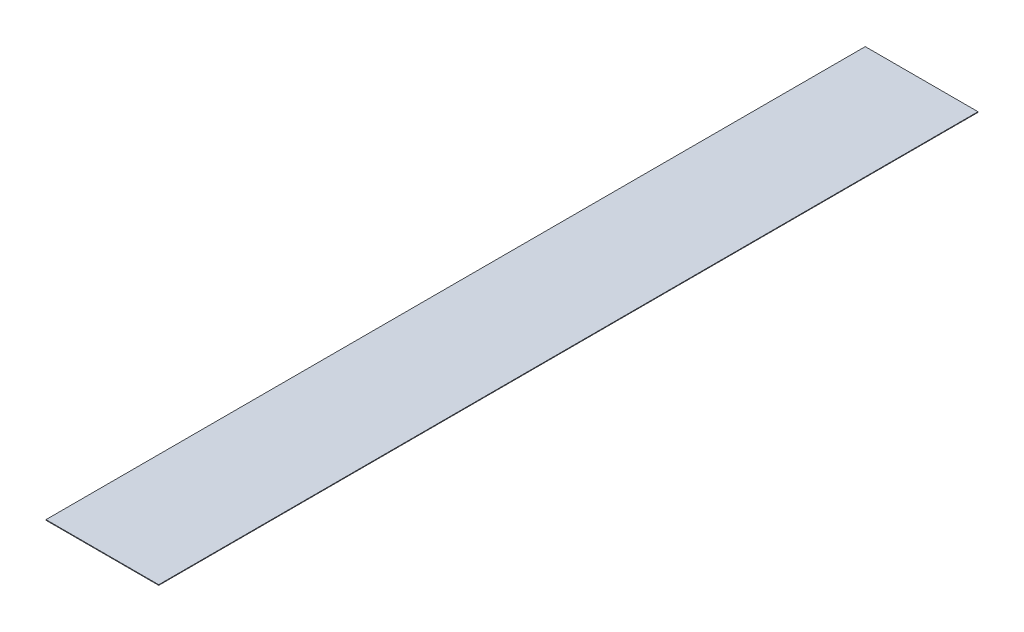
ISO-10303-21;
HEADER;
FILE_DESCRIPTION(('STEP AP214'),'2;1');
FILE_NAME('part.step','',(''),(''),'','','');
FILE_SCHEMA(('AUTOMOTIVE_DESIGN { 1 0 10303 214 1 1 1 1 }'));
ENDSEC;
DATA;
#1=APPLICATION_CONTEXT('core data for automotive mechanical design processes');
#2=APPLICATION_PROTOCOL_DEFINITION('international standard','automotive_design',2000,#1);
#3=PRODUCT_CONTEXT('',#1,'mechanical');
#4=PRODUCT('Part','Part','',(#3));
#5=PRODUCT_RELATED_PRODUCT_CATEGORY('part','',(#4));
#6=PRODUCT_DEFINITION_FORMATION('','',#4);
#7=PRODUCT_DEFINITION_CONTEXT('part definition',#1,'design');
#8=PRODUCT_DEFINITION('design','',#6,#7);
#9=PRODUCT_DEFINITION_SHAPE('','',#8);
#10=(LENGTH_UNIT() NAMED_UNIT(*) SI_UNIT(.MILLI.,.METRE.));
#11=(NAMED_UNIT(*) PLANE_ANGLE_UNIT() SI_UNIT($,.RADIAN.));
#12=(NAMED_UNIT(*) SI_UNIT($,.STERADIAN.) SOLID_ANGLE_UNIT());
#13=UNCERTAINTY_MEASURE_WITH_UNIT(LENGTH_MEASURE(1.E-05),#10,'distance_accuracy_value','');
#14=(GEOMETRIC_REPRESENTATION_CONTEXT(3) GLOBAL_UNCERTAINTY_ASSIGNED_CONTEXT((#13)) GLOBAL_UNIT_ASSIGNED_CONTEXT((#10,
#11,#12)) REPRESENTATION_CONTEXT('',''));
#15=CARTESIAN_POINT('',(0.,0.,0.));
#16=DIRECTION('',(0.,0.,1.));
#17=DIRECTION('',(1.,0.,0.));
#18=AXIS2_PLACEMENT_3D('',#15,#16,#17);
#19=CARTESIAN_POINT('',(0.,0.254,0.));
#20=DIRECTION('',(-1.,0.,0.));
#21=DIRECTION('',(0.,0.,1.));
#22=AXIS2_PLACEMENT_3D('',#19,#20,#21);
#23=PLANE('',#22);
#24=DIRECTION('',(0.,0.,-1.));
#25=VECTOR('',#24,1.);
#26=CARTESIAN_POINT('',(0.,0.,0.));
#27=LINE('',#26,#25);
#28=CARTESIAN_POINT('',(0.,0.,346.075));
#29=VERTEX_POINT('',#28);
#30=CARTESIAN_POINT('',(0.,0.,0.));
#31=VERTEX_POINT('',#30);
#32=EDGE_CURVE('E96',#29,#31,#27,.T.);
#33=ORIENTED_EDGE('',*,*,#32,.T.);
#34=DIRECTION('',(0.,-1.,0.));
#35=VECTOR('',#34,1.);
#36=CARTESIAN_POINT('',(0.,0.254,0.));
#37=LINE('',#36,#35);
#38=CARTESIAN_POINT('',(0.,0.254,0.));
#39=VERTEX_POINT('',#38);
#40=EDGE_CURVE('E11',#39,#31,#37,.T.);
#41=ORIENTED_EDGE('',*,*,#40,.F.);
#42=DIRECTION('',(0.,0.,-1.));
#43=VECTOR('',#42,1.);
#44=CARTESIAN_POINT('',(0.,0.254,0.));
#45=LINE('',#44,#43);
#46=CARTESIAN_POINT('',(0.,0.254,346.075));
#47=VERTEX_POINT('',#46);
#48=EDGE_CURVE('E84',#47,#39,#45,.T.);
#49=ORIENTED_EDGE('',*,*,#48,.F.);
#50=DIRECTION('',(0.,-1.,0.));
#51=VECTOR('',#50,1.);
#52=CARTESIAN_POINT('',(0.,0.254,346.075));
#53=LINE('',#52,#51);
#54=EDGE_CURVE('E92',#47,#29,#53,.T.);
#55=ORIENTED_EDGE('',*,*,#54,.T.);
#56=EDGE_LOOP('',(#33,#41,#49,#55));
#57=FACE_BOUND('',#56,.T.);
#58=ADVANCED_FACE('F33',(#57),#23,.F.);
#59=CARTESIAN_POINT('',(-47.625,0.254,0.));
#60=DIRECTION('',(0.,0.,1.));
#61=DIRECTION('',(1.,0.,0.));
#62=AXIS2_PLACEMENT_3D('',#59,#60,#61);
#63=PLANE('',#62);
#64=DIRECTION('',(-1.,0.,0.));
#65=VECTOR('',#64,1.);
#66=CARTESIAN_POINT('',(-47.625,0.,0.));
#67=LINE('',#66,#65);
#68=CARTESIAN_POINT('',(-47.625,0.,0.));
#69=VERTEX_POINT('',#68);
#70=EDGE_CURVE('E88',#31,#69,#67,.T.);
#71=ORIENTED_EDGE('',*,*,#70,.T.);
#72=DIRECTION('',(0.,-1.,0.));
#73=VECTOR('',#72,1.);
#74=CARTESIAN_POINT('',(-47.625,0.254,0.));
#75=LINE('',#74,#73);
#76=CARTESIAN_POINT('',(-47.625,0.254,0.));
#77=VERTEX_POINT('',#76);
#78=EDGE_CURVE('E41',#77,#69,#75,.T.);
#79=ORIENTED_EDGE('',*,*,#78,.F.);
#80=DIRECTION('',(-1.,0.,0.));
#81=VECTOR('',#80,1.);
#82=CARTESIAN_POINT('',(-47.625,0.254,0.));
#83=LINE('',#82,#81);
#84=EDGE_CURVE('E79',#39,#77,#83,.T.);
#85=ORIENTED_EDGE('',*,*,#84,.F.);
#86=ORIENTED_EDGE('',*,*,#40,.T.);
#87=EDGE_LOOP('',(#71,#79,#85,#86));
#88=FACE_BOUND('',#87,.T.);
#89=ADVANCED_FACE('F87',(#88),#63,.F.);
#90=CARTESIAN_POINT('',(-47.625,0.254,0.));
#91=DIRECTION('',(1.,0.,0.));
#92=DIRECTION('',(0.,0.,-1.));
#93=AXIS2_PLACEMENT_3D('',#90,#91,#92);
#94=PLANE('',#93);
#95=DIRECTION('',(0.,0.,1.));
#96=VECTOR('',#95,1.);
#97=CARTESIAN_POINT('',(-47.625,0.,0.));
#98=LINE('',#97,#96);
#99=CARTESIAN_POINT('',(-47.625,0.,346.075));
#100=VERTEX_POINT('',#99);
#101=EDGE_CURVE('E66',#69,#100,#98,.T.);
#102=ORIENTED_EDGE('',*,*,#101,.T.);
#103=DIRECTION('',(0.,-1.,0.));
#104=VECTOR('',#103,1.);
#105=CARTESIAN_POINT('',(-47.625,0.254,346.075));
#106=LINE('',#105,#104);
#107=CARTESIAN_POINT('',(-47.625,0.254,346.075));
#108=VERTEX_POINT('',#107);
#109=EDGE_CURVE('E89',#108,#100,#106,.T.);
#110=ORIENTED_EDGE('',*,*,#109,.F.);
#111=DIRECTION('',(0.,0.,1.));
#112=VECTOR('',#111,1.);
#113=CARTESIAN_POINT('',(-47.625,0.254,0.));
#114=LINE('',#113,#112);
#115=EDGE_CURVE('E82',#77,#108,#114,.T.);
#116=ORIENTED_EDGE('',*,*,#115,.F.);
#117=ORIENTED_EDGE('',*,*,#78,.T.);
#118=EDGE_LOOP('',(#102,#110,#116,#117));
#119=FACE_BOUND('',#118,.T.);
#120=ADVANCED_FACE('F90',(#119),#94,.F.);
#121=CARTESIAN_POINT('',(0.,0.254,346.075));
#122=DIRECTION('',(0.,0.,-1.));
#123=DIRECTION('',(-1.,0.,0.));
#124=AXIS2_PLACEMENT_3D('',#121,#122,#123);
#125=PLANE('',#124);
#126=DIRECTION('',(1.,0.,0.));
#127=VECTOR('',#126,1.);
#128=CARTESIAN_POINT('',(0.,0.,346.075));
#129=LINE('',#128,#127);
#130=EDGE_CURVE('E72',#100,#29,#129,.T.);
#131=ORIENTED_EDGE('',*,*,#130,.T.);
#132=ORIENTED_EDGE('',*,*,#54,.F.);
#133=DIRECTION('',(1.,0.,0.));
#134=VECTOR('',#133,1.);
#135=CARTESIAN_POINT('',(0.,0.254,346.075));
#136=LINE('',#135,#134);
#137=EDGE_CURVE('E49',#108,#47,#136,.T.);
#138=ORIENTED_EDGE('',*,*,#137,.F.);
#139=ORIENTED_EDGE('',*,*,#109,.T.);
#140=EDGE_LOOP('',(#131,#132,#138,#139));
#141=FACE_BOUND('',#140,.T.);
#142=ADVANCED_FACE('F103',(#141),#125,.F.);
#143=CARTESIAN_POINT('',(0.,0.254,346.075));
#144=DIRECTION('',(0.,-1.,0.));
#145=DIRECTION('',(0.,0.,-1.));
#146=AXIS2_PLACEMENT_3D('',#143,#144,#145);
#147=PLANE('',#146);
#148=ORIENTED_EDGE('',*,*,#48,.T.);
#149=ORIENTED_EDGE('',*,*,#84,.T.);
#150=ORIENTED_EDGE('',*,*,#115,.T.);
#151=ORIENTED_EDGE('',*,*,#137,.T.);
#152=EDGE_LOOP('',(#148,#149,#150,#151));
#153=FACE_BOUND('',#152,.T.);
#154=ADVANCED_FACE('F80',(#153),#147,.F.);
#155=CARTESIAN_POINT('',(0.,0.,346.075));
#156=DIRECTION('',(0.,-1.,0.));
#157=DIRECTION('',(0.,0.,-1.));
#158=AXIS2_PLACEMENT_3D('',#155,#156,#157);
#159=PLANE('',#158);
#160=ORIENTED_EDGE('',*,*,#32,.F.);
#161=ORIENTED_EDGE('',*,*,#130,.F.);
#162=ORIENTED_EDGE('',*,*,#101,.F.);
#163=ORIENTED_EDGE('',*,*,#70,.F.);
#164=EDGE_LOOP('',(#160,#161,#162,#163));
#165=FACE_BOUND('',#164,.T.);
#166=ADVANCED_FACE('F106',(#165),#159,.T.);
#167=CLOSED_SHELL('',(#58,#89,#120,#142,#154,#166));
#168=MANIFOLD_SOLID_BREP('B2',#167);
#169=ADVANCED_BREP_SHAPE_REPRESENTATION('',(#18,#168),#14);
#170=SHAPE_DEFINITION_REPRESENTATION(#9,#169);
ENDSEC;
END-ISO-10303-21;
